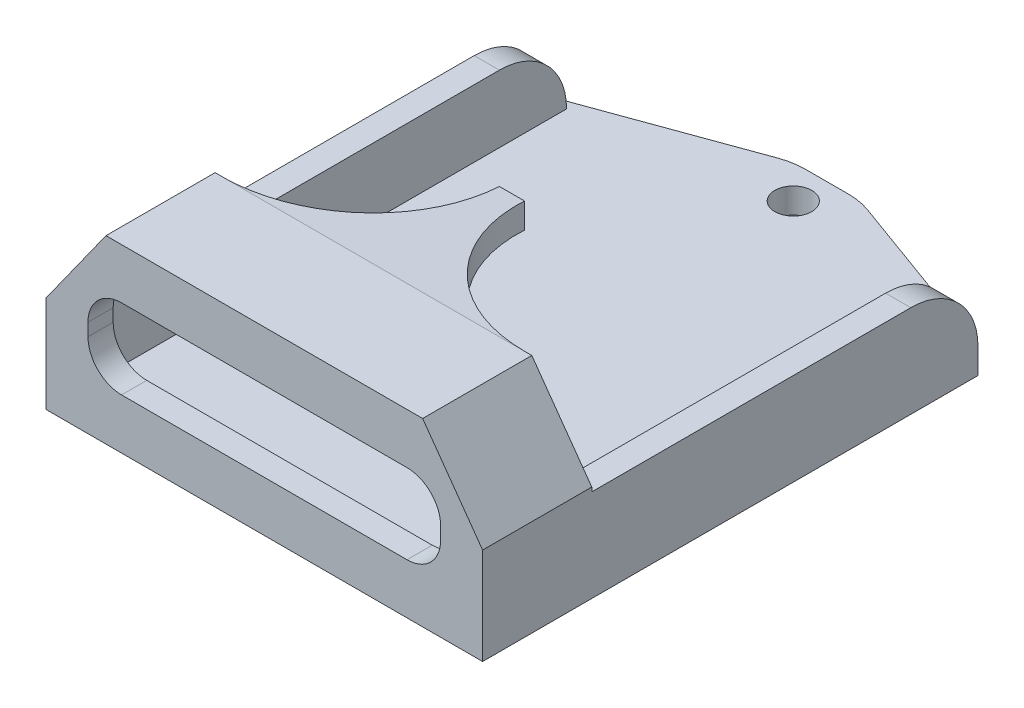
ISO-10303-21;
HEADER;
FILE_DESCRIPTION(('STEP AP214'),'2;1');
FILE_NAME('part.step','',(''),(''),'','','');
FILE_SCHEMA(('AUTOMOTIVE_DESIGN { 1 0 10303 214 1 1 1 1 }'));
ENDSEC;
DATA;
#1=APPLICATION_CONTEXT('core data for automotive mechanical design processes');
#2=APPLICATION_PROTOCOL_DEFINITION('international standard','automotive_design',2000,#1);
#3=PRODUCT_CONTEXT('',#1,'mechanical');
#4=PRODUCT('Part','Part','',(#3));
#5=PRODUCT_RELATED_PRODUCT_CATEGORY('part','',(#4));
#6=PRODUCT_DEFINITION_FORMATION('','',#4);
#7=PRODUCT_DEFINITION_CONTEXT('part definition',#1,'design');
#8=PRODUCT_DEFINITION('design','',#6,#7);
#9=PRODUCT_DEFINITION_SHAPE('','',#8);
#10=(LENGTH_UNIT() NAMED_UNIT(*) SI_UNIT(.MILLI.,.METRE.));
#11=(NAMED_UNIT(*) PLANE_ANGLE_UNIT() SI_UNIT($,.RADIAN.));
#12=(NAMED_UNIT(*) SI_UNIT($,.STERADIAN.) SOLID_ANGLE_UNIT());
#13=UNCERTAINTY_MEASURE_WITH_UNIT(LENGTH_MEASURE(1.E-05),#10,'distance_accuracy_value','');
#14=(GEOMETRIC_REPRESENTATION_CONTEXT(3) GLOBAL_UNCERTAINTY_ASSIGNED_CONTEXT((#13)) GLOBAL_UNIT_ASSIGNED_CONTEXT((#10,
#11,#12)) REPRESENTATION_CONTEXT('',''));
#15=CARTESIAN_POINT('',(0.,0.,0.));
#16=DIRECTION('',(0.,0.,1.));
#17=DIRECTION('',(1.,0.,0.));
#18=AXIS2_PLACEMENT_3D('',#15,#16,#17);
#19=CARTESIAN_POINT('',(0.,0.,16.5));
#20=DIRECTION('',(0.,0.,1.));
#21=DIRECTION('',(1.,0.,0.));
#22=AXIS2_PLACEMENT_3D('',#19,#20,#21);
#23=PLANE('',#22);
#24=DIRECTION('',(1.,0.,0.));
#25=VECTOR('',#24,1.);
#26=CARTESIAN_POINT('',(0.,21.5,16.5));
#27=LINE('',#26,#25);
#28=CARTESIAN_POINT('',(18.,21.5,16.5));
#29=VERTEX_POINT('',#28);
#30=CARTESIAN_POINT('',(18.8571428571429,21.5,16.5));
#31=VERTEX_POINT('',#30);
#32=EDGE_CURVE('E409',#29,#31,#27,.T.);
#33=ORIENTED_EDGE('',*,*,#32,.T.);
#34=DIRECTION('',(-0.581238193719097,0.813733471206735,0.));
#35=VECTOR('',#34,1.);
#36=CARTESIAN_POINT('',(22.6554054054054,16.1824324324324,16.5));
#37=LINE('',#36,#35);
#38=CARTESIAN_POINT('',(26.,11.5,16.5));
#39=VERTEX_POINT('',#38);
#40=EDGE_CURVE('E407',#39,#31,#37,.T.);
#41=ORIENTED_EDGE('',*,*,#40,.F.);
#42=DIRECTION('',(0.,1.,0.));
#43=VECTOR('',#42,1.);
#44=CARTESIAN_POINT('',(26.,0.,16.5));
#45=LINE('',#44,#43);
#46=CARTESIAN_POINT('',(26.,11.,16.5));
#47=VERTEX_POINT('',#46);
#48=EDGE_CURVE('E405',#47,#39,#45,.T.);
#49=ORIENTED_EDGE('',*,*,#48,.F.);
#50=DIRECTION('',(1.,0.,0.));
#51=VECTOR('',#50,1.);
#52=CARTESIAN_POINT('',(26.,11.,16.5));
#53=LINE('',#52,#51);
#54=CARTESIAN_POINT('',(23.,11.,16.5));
#55=VERTEX_POINT('',#54);
#56=EDGE_CURVE('E319',#55,#47,#53,.T.);
#57=ORIENTED_EDGE('',*,*,#56,.F.);
#58=DIRECTION('',(0.,-1.,0.));
#59=VECTOR('',#58,1.);
#60=CARTESIAN_POINT('',(23.,0.,16.5));
#61=LINE('',#60,#59);
#62=CARTESIAN_POINT('',(23.,11.5,16.5));
#63=VERTEX_POINT('',#62);
#64=EDGE_CURVE('E258',#63,#55,#61,.T.);
#65=ORIENTED_EDGE('',*,*,#64,.F.);
#66=DIRECTION('',(-0.581238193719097,0.813733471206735,0.));
#67=VECTOR('',#66,1.);
#68=CARTESIAN_POINT('',(20.6689189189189,14.7635135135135,16.5));
#69=LINE('',#68,#67);
#70=CARTESIAN_POINT('',(18.,18.5,16.5));
#71=VERTEX_POINT('',#70);
#72=EDGE_CURVE('E251',#63,#71,#69,.T.);
#73=ORIENTED_EDGE('',*,*,#72,.T.);
#74=DIRECTION('',(0.,1.,0.));
#75=VECTOR('',#74,1.);
#76=CARTESIAN_POINT('',(18.,17.5,16.5));
#77=LINE('',#76,#75);
#78=EDGE_CURVE('E255',#71,#29,#77,.T.);
#79=ORIENTED_EDGE('',*,*,#78,.T.);
#80=EDGE_LOOP('',(#33,#41,#49,#57,#65,#73,#79));
#81=FACE_BOUND('',#80,.T.);
#82=ADVANCED_FACE('F41',(#81),#23,.F.);
#83=CARTESIAN_POINT('',(0.,3.,0.));
#84=DIRECTION('',(0.,1.,0.));
#85=DIRECTION('',(0.,0.,1.));
#86=AXIS2_PLACEMENT_3D('',#83,#84,#85);
#87=PLANE('',#86);
#88=CARTESIAN_POINT('',(0.,3.,-33.5));
#89=DIRECTION('',(0.,1.,0.));
#90=DIRECTION('',(0.,0.,1.));
#91=AXIS2_PLACEMENT_3D('',#88,#89,#90);
#92=CIRCLE('',#91,2.2);
#93=CARTESIAN_POINT('',(0.,3.,-31.3));
#94=VERTEX_POINT('',#93);
#95=EDGE_CURVE('E450',#94,#94,#92,.T.);
#96=ORIENTED_EDGE('',*,*,#95,.F.);
#97=EDGE_LOOP('',(#96));
#98=FACE_BOUND('',#97,.T.);
#99=DIRECTION('',(-1.,0.,0.));
#100=VECTOR('',#99,1.);
#101=CARTESIAN_POINT('',(-4.,3.,-37.5));
#102=LINE('',#101,#100);
#103=CARTESIAN_POINT('',(2.59060017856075,3.,-37.5));
#104=VERTEX_POINT('',#103);
#105=CARTESIAN_POINT('',(-2.59060017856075,3.,-37.5));
#106=VERTEX_POINT('',#105);
#107=EDGE_CURVE('E459',#104,#106,#102,.T.);
#108=ORIENTED_EDGE('',*,*,#107,.T.);
#109=CARTESIAN_POINT('',(-2.59060017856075,3.,-29.5));
#110=DIRECTION('',(0.,1.,0.));
#111=DIRECTION('',(0.,0.,1.));
#112=AXIS2_PLACEMENT_3D('',#109,#110,#111);
#113=CIRCLE('',#112,8.);
#114=CARTESIAN_POINT('',(-5.32454468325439,3.,-37.0183473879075));
#115=VERTEX_POINT('',#114);
#116=EDGE_CURVE('E504',#106,#115,#113,.T.);
#117=ORIENTED_EDGE('',*,*,#116,.T.);
#118=DIRECTION('',(-0.939793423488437,0.,0.341743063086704));
#119=VECTOR('',#118,1.);
#120=CARTESIAN_POINT('',(-26.,3.,-29.5));
#121=LINE('',#120,#119);
#122=CARTESIAN_POINT('',(-26.,3.,-29.5));
#123=VERTEX_POINT('',#122);
#124=EDGE_CURVE('E463',#115,#123,#121,.T.);
#125=ORIENTED_EDGE('',*,*,#124,.T.);
#126=DIRECTION('',(-1.,0.,0.));
#127=VECTOR('',#126,1.);
#128=CARTESIAN_POINT('',(-26.,3.,-29.5));
#129=LINE('',#128,#127);
#130=CARTESIAN_POINT('',(-23.,3.,-29.5));
#131=VERTEX_POINT('',#130);
#132=EDGE_CURVE('E309',#131,#123,#129,.T.);
#133=ORIENTED_EDGE('',*,*,#132,.F.);
#134=DIRECTION('',(0.,0.,1.));
#135=VECTOR('',#134,1.);
#136=CARTESIAN_POINT('',(-23.,3.,16.5));
#137=LINE('',#136,#135);
#138=CARTESIAN_POINT('',(-23.,3.,26.5));
#139=VERTEX_POINT('',#138);
#140=EDGE_CURVE('E432',#131,#139,#137,.T.);
#141=ORIENTED_EDGE('',*,*,#140,.T.);
#142=DIRECTION('',(-1.,0.,0.));
#143=VECTOR('',#142,1.);
#144=CARTESIAN_POINT('',(0.,3.,26.5));
#145=LINE('',#144,#143);
#146=CARTESIAN_POINT('',(23.,3.,26.5));
#147=VERTEX_POINT('',#146);
#148=EDGE_CURVE('E375',#147,#139,#145,.T.);
#149=ORIENTED_EDGE('',*,*,#148,.F.);
#150=DIRECTION('',(0.,0.,1.));
#151=VECTOR('',#150,1.);
#152=CARTESIAN_POINT('',(23.,3.,16.5));
#153=LINE('',#152,#151);
#154=CARTESIAN_POINT('',(23.,3.,-29.5));
#155=VERTEX_POINT('',#154);
#156=EDGE_CURVE('E446',#155,#147,#153,.T.);
#157=ORIENTED_EDGE('',*,*,#156,.F.);
#158=DIRECTION('',(-1.,0.,0.));
#159=VECTOR('',#158,1.);
#160=CARTESIAN_POINT('',(26.,3.,-29.5));
#161=LINE('',#160,#159);
#162=CARTESIAN_POINT('',(26.,3.,-29.5));
#163=VERTEX_POINT('',#162);
#164=EDGE_CURVE('E315',#163,#155,#161,.T.);
#165=ORIENTED_EDGE('',*,*,#164,.F.);
#166=DIRECTION('',(-0.939793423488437,0.,-0.341743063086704));
#167=VECTOR('',#166,1.);
#168=CARTESIAN_POINT('',(4.,3.,-37.5));
#169=LINE('',#168,#167);
#170=CARTESIAN_POINT('',(5.32454468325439,3.,-37.0183473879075));
#171=VERTEX_POINT('',#170);
#172=EDGE_CURVE('E456',#163,#171,#169,.T.);
#173=ORIENTED_EDGE('',*,*,#172,.T.);
#174=CARTESIAN_POINT('',(2.59060017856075,3.,-29.5));
#175=DIRECTION('',(0.,1.,0.));
#176=DIRECTION('',(0.,0.,1.));
#177=AXIS2_PLACEMENT_3D('',#174,#175,#176);
#178=CIRCLE('',#177,8.);
#179=EDGE_CURVE('E502',#171,#104,#178,.T.);
#180=ORIENTED_EDGE('',*,*,#179,.T.);
#181=EDGE_LOOP('',(#108,#117,#125,#133,#141,#149,#157,#165,#173,#180));
#182=FACE_BOUND('',#181,.T.);
#183=ADVANCED_FACE('F526',(#98,#182),#87,.T.);
#184=DIRECTION('',(0.,1.,0.));
#185=VECTOR('',#184,1.);
#186=CARTESIAN_POINT('',(-18.,17.5,16.5));
#187=LINE('',#186,#185);
#188=CARTESIAN_POINT('',(-18.,18.5,16.5));
#189=VERTEX_POINT('',#188);
#190=CARTESIAN_POINT('',(-18.,21.5,16.5));
#191=VERTEX_POINT('',#190);
#192=EDGE_CURVE('E298',#189,#191,#187,.T.);
#193=ORIENTED_EDGE('',*,*,#192,.F.);
#194=DIRECTION('',(0.581238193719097,0.813733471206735,0.));
#195=VECTOR('',#194,1.);
#196=CARTESIAN_POINT('',(-20.6689189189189,14.7635135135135,16.5));
#197=LINE('',#196,#195);
#198=CARTESIAN_POINT('',(-23.,11.5,16.5));
#199=VERTEX_POINT('',#198);
#200=EDGE_CURVE('E286',#199,#189,#197,.T.);
#201=ORIENTED_EDGE('',*,*,#200,.F.);
#202=DIRECTION('',(0.,-1.,0.));
#203=VECTOR('',#202,1.);
#204=CARTESIAN_POINT('',(-23.,0.,16.5));
#205=LINE('',#204,#203);
#206=CARTESIAN_POINT('',(-23.,11.,16.5));
#207=VERTEX_POINT('',#206);
#208=EDGE_CURVE('E417',#199,#207,#205,.T.);
#209=ORIENTED_EDGE('',*,*,#208,.T.);
#210=DIRECTION('',(1.,0.,0.));
#211=VECTOR('',#210,1.);
#212=CARTESIAN_POINT('',(-26.,11.,16.5));
#213=LINE('',#212,#211);
#214=CARTESIAN_POINT('',(-26.,11.,16.5));
#215=VERTEX_POINT('',#214);
#216=EDGE_CURVE('E308',#215,#207,#213,.T.);
#217=ORIENTED_EDGE('',*,*,#216,.F.);
#218=DIRECTION('',(0.,1.,0.));
#219=VECTOR('',#218,1.);
#220=CARTESIAN_POINT('',(-26.,0.,16.5));
#221=LINE('',#220,#219);
#222=CARTESIAN_POINT('',(-26.,11.5,16.5));
#223=VERTEX_POINT('',#222);
#224=EDGE_CURVE('E415',#215,#223,#221,.T.);
#225=ORIENTED_EDGE('',*,*,#224,.T.);
#226=DIRECTION('',(0.581238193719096,0.813733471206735,0.));
#227=VECTOR('',#226,1.);
#228=CARTESIAN_POINT('',(-22.6554054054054,16.1824324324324,16.5));
#229=LINE('',#228,#227);
#230=CARTESIAN_POINT('',(-18.8571428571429,21.5,16.5));
#231=VERTEX_POINT('',#230);
#232=EDGE_CURVE('E413',#223,#231,#229,.T.);
#233=ORIENTED_EDGE('',*,*,#232,.T.);
#234=EDGE_CURVE('E410',#231,#191,#27,.T.);
#235=ORIENTED_EDGE('',*,*,#234,.T.);
#236=EDGE_LOOP('',(#193,#201,#209,#217,#225,#233,#235));
#237=FACE_BOUND('',#236,.T.);
#238=ADVANCED_FACE('F540',(#237),#23,.F.);
#239=CARTESIAN_POINT('',(0.,18.5,16.5));
#240=DIRECTION('',(0.,-1.,0.));
#241=DIRECTION('',(0.,0.,-1.));
#242=AXIS2_PLACEMENT_3D('',#239,#240,#241);
#243=PLANE('',#242);
#244=DIRECTION('',(0.,0.,1.));
#245=VECTOR('',#244,1.);
#246=CARTESIAN_POINT('',(18.,18.5,16.5));
#247=LINE('',#246,#245);
#248=CARTESIAN_POINT('',(18.,18.5,26.5));
#249=VERTEX_POINT('',#248);
#250=EDGE_CURVE('E279',#71,#249,#247,.T.);
#251=ORIENTED_EDGE('',*,*,#250,.T.);
#252=DIRECTION('',(1.,0.,0.));
#253=VECTOR('',#252,1.);
#254=CARTESIAN_POINT('',(0.,18.5,26.5));
#255=LINE('',#254,#253);
#256=CARTESIAN_POINT('',(-18.,18.5,26.5));
#257=VERTEX_POINT('',#256);
#258=EDGE_CURVE('E396',#257,#249,#255,.T.);
#259=ORIENTED_EDGE('',*,*,#258,.F.);
#260=DIRECTION('',(0.,0.,1.));
#261=VECTOR('',#260,1.);
#262=CARTESIAN_POINT('',(-18.,18.5,16.5));
#263=LINE('',#262,#261);
#264=EDGE_CURVE('E291',#189,#257,#263,.T.);
#265=ORIENTED_EDGE('',*,*,#264,.F.);
#266=DIRECTION('',(1.,0.,0.));
#267=VECTOR('',#266,1.);
#268=CARTESIAN_POINT('',(0.,18.5,16.5));
#269=LINE('',#268,#267);
#270=EDGE_CURVE('E261',#189,#71,#269,.T.);
#271=ORIENTED_EDGE('',*,*,#270,.T.);
#272=EDGE_LOOP('',(#251,#259,#265,#271));
#273=FACE_BOUND('',#272,.T.);
#274=ADVANCED_FACE('F289',(#273),#243,.T.);
#275=CARTESIAN_POINT('',(-20.6689189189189,14.7635135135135,16.5));
#276=DIRECTION('',(0.813733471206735,-0.581238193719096,0.));
#277=DIRECTION('',(0.581238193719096,0.813733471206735,0.));
#278=AXIS2_PLACEMENT_3D('',#275,#276,#277);
#279=PLANE('',#278);
#280=ORIENTED_EDGE('',*,*,#264,.T.);
#281=DIRECTION('',(0.581238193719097,0.813733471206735,0.));
#282=VECTOR('',#281,1.);
#283=CARTESIAN_POINT('',(-20.6689189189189,14.7635135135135,26.5));
#284=LINE('',#283,#282);
#285=CARTESIAN_POINT('',(-23.,11.5,26.5));
#286=VERTEX_POINT('',#285);
#287=EDGE_CURVE('E398',#286,#257,#284,.T.);
#288=ORIENTED_EDGE('',*,*,#287,.F.);
#289=DIRECTION('',(0.,0.,1.));
#290=VECTOR('',#289,1.);
#291=CARTESIAN_POINT('',(-23.,11.5,16.5));
#292=LINE('',#291,#290);
#293=EDGE_CURVE('E429',#199,#286,#292,.T.);
#294=ORIENTED_EDGE('',*,*,#293,.F.);
#295=ORIENTED_EDGE('',*,*,#200,.T.);
#296=EDGE_LOOP('',(#280,#288,#294,#295));
#297=FACE_BOUND('',#296,.T.);
#298=ADVANCED_FACE('F542',(#297),#279,.T.);
#299=CARTESIAN_POINT('',(-23.,0.,16.5));
#300=DIRECTION('',(-1.,0.,0.));
#301=DIRECTION('',(0.,0.,1.));
#302=AXIS2_PLACEMENT_3D('',#299,#300,#301);
#303=PLANE('',#302);
#304=ORIENTED_EDGE('',*,*,#140,.F.);
#305=CARTESIAN_POINT('',(-23.,3.,-21.5));
#306=DIRECTION('',(-1.,0.,0.));
#307=DIRECTION('',(0.,0.,1.));
#308=AXIS2_PLACEMENT_3D('',#305,#306,#307);
#309=CIRCLE('',#308,8.);
#310=CARTESIAN_POINT('',(-23.,11.,-21.5));
#311=VERTEX_POINT('',#310);
#312=EDGE_CURVE('E49',#131,#311,#309,.F.);
#313=ORIENTED_EDGE('',*,*,#312,.T.);
#314=DIRECTION('',(0.,0.,-1.));
#315=VECTOR('',#314,1.);
#316=CARTESIAN_POINT('',(-23.,11.,-29.5));
#317=LINE('',#316,#315);
#318=EDGE_CURVE('E311',#207,#311,#317,.T.);
#319=ORIENTED_EDGE('',*,*,#318,.F.);
#320=ORIENTED_EDGE('',*,*,#208,.F.);
#321=ORIENTED_EDGE('',*,*,#293,.T.);
#322=DIRECTION('',(0.,-1.,0.));
#323=VECTOR('',#322,1.);
#324=CARTESIAN_POINT('',(-23.,0.,26.5));
#325=LINE('',#324,#323);
#326=EDGE_CURVE('E401',#286,#139,#325,.T.);
#327=ORIENTED_EDGE('',*,*,#326,.T.);
#328=EDGE_LOOP('',(#304,#313,#319,#320,#321,#327));
#329=FACE_BOUND('',#328,.T.);
#330=ADVANCED_FACE('F536',(#329),#303,.F.);
#331=CARTESIAN_POINT('',(23.,0.,16.5));
#332=DIRECTION('',(-1.,0.,0.));
#333=DIRECTION('',(0.,0.,1.));
#334=AXIS2_PLACEMENT_3D('',#331,#332,#333);
#335=PLANE('',#334);
#336=DIRECTION('',(0.,0.,1.));
#337=VECTOR('',#336,1.);
#338=CARTESIAN_POINT('',(23.,11.,-29.5));
#339=LINE('',#338,#337);
#340=CARTESIAN_POINT('',(23.,11.,-21.5));
#341=VERTEX_POINT('',#340);
#342=EDGE_CURVE('E322',#341,#55,#339,.T.);
#343=ORIENTED_EDGE('',*,*,#342,.F.);
#344=CARTESIAN_POINT('',(23.,3.,-21.5));
#345=DIRECTION('',(-1.,0.,0.));
#346=DIRECTION('',(0.,0.,1.));
#347=AXIS2_PLACEMENT_3D('',#344,#345,#346);
#348=CIRCLE('',#347,8.);
#349=EDGE_CURVE('E511',#341,#155,#348,.T.);
#350=ORIENTED_EDGE('',*,*,#349,.T.);
#351=ORIENTED_EDGE('',*,*,#156,.T.);
#352=DIRECTION('',(0.,-1.,0.));
#353=VECTOR('',#352,1.);
#354=CARTESIAN_POINT('',(23.,0.,26.5));
#355=LINE('',#354,#353);
#356=CARTESIAN_POINT('',(23.,11.5,26.5));
#357=VERTEX_POINT('',#356);
#358=EDGE_CURVE('E392',#357,#147,#355,.T.);
#359=ORIENTED_EDGE('',*,*,#358,.F.);
#360=DIRECTION('',(0.,0.,1.));
#361=VECTOR('',#360,1.);
#362=CARTESIAN_POINT('',(23.,11.5,16.5));
#363=LINE('',#362,#361);
#364=EDGE_CURVE('E285',#63,#357,#363,.T.);
#365=ORIENTED_EDGE('',*,*,#364,.F.);
#366=ORIENTED_EDGE('',*,*,#64,.T.);
#367=EDGE_LOOP('',(#343,#350,#351,#359,#365,#366));
#368=FACE_BOUND('',#367,.T.);
#369=ADVANCED_FACE('F550',(#368),#335,.T.);
#370=CARTESIAN_POINT('',(20.6689189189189,14.7635135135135,16.5));
#371=DIRECTION('',(0.813733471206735,0.581238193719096,0.));
#372=DIRECTION('',(-0.581238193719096,0.813733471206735,0.));
#373=AXIS2_PLACEMENT_3D('',#370,#371,#372);
#374=PLANE('',#373);
#375=DIRECTION('',(-0.581238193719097,0.813733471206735,0.));
#376=VECTOR('',#375,1.);
#377=CARTESIAN_POINT('',(20.6689189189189,14.7635135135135,26.5));
#378=LINE('',#377,#376);
#379=EDGE_CURVE('E282',#357,#249,#378,.T.);
#380=ORIENTED_EDGE('',*,*,#379,.T.);
#381=ORIENTED_EDGE('',*,*,#250,.F.);
#382=ORIENTED_EDGE('',*,*,#72,.F.);
#383=ORIENTED_EDGE('',*,*,#364,.T.);
#384=EDGE_LOOP('',(#380,#381,#382,#383));
#385=FACE_BOUND('',#384,.T.);
#386=ADVANCED_FACE('F280',(#385),#374,.F.);
#387=CARTESIAN_POINT('',(0.,0.,0.));
#388=DIRECTION('',(0.,1.,0.));
#389=DIRECTION('',(0.,0.,1.));
#390=AXIS2_PLACEMENT_3D('',#387,#388,#389);
#391=PLANE('',#390);
#392=DIRECTION('',(-0.939793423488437,0.,0.341743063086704));
#393=VECTOR('',#392,1.);
#394=CARTESIAN_POINT('',(-26.,0.,-29.5));
#395=LINE('',#394,#393);
#396=CARTESIAN_POINT('',(-5.32454468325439,0.,-37.0183473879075));
#397=VERTEX_POINT('',#396);
#398=CARTESIAN_POINT('',(-26.,0.,-29.5));
#399=VERTEX_POINT('',#398);
#400=EDGE_CURVE('E472',#397,#399,#395,.T.);
#401=ORIENTED_EDGE('',*,*,#400,.F.);
#402=CARTESIAN_POINT('',(-2.59060017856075,0.,-29.5));
#403=DIRECTION('',(0.,1.,0.));
#404=DIRECTION('',(0.,0.,1.));
#405=AXIS2_PLACEMENT_3D('',#402,#403,#404);
#406=CIRCLE('',#405,8.);
#407=CARTESIAN_POINT('',(-2.59060017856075,0.,-37.5));
#408=VERTEX_POINT('',#407);
#409=EDGE_CURVE('E495',#397,#408,#406,.F.);
#410=ORIENTED_EDGE('',*,*,#409,.T.);
#411=DIRECTION('',(-1.,0.,0.));
#412=VECTOR('',#411,1.);
#413=CARTESIAN_POINT('',(-4.,0.,-37.5));
#414=LINE('',#413,#412);
#415=CARTESIAN_POINT('',(2.59060017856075,0.,-37.5));
#416=VERTEX_POINT('',#415);
#417=EDGE_CURVE('E469',#416,#408,#414,.T.);
#418=ORIENTED_EDGE('',*,*,#417,.F.);
#419=CARTESIAN_POINT('',(2.59060017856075,0.,-29.5));
#420=DIRECTION('',(0.,1.,0.));
#421=DIRECTION('',(0.,0.,1.));
#422=AXIS2_PLACEMENT_3D('',#419,#420,#421);
#423=CIRCLE('',#422,8.);
#424=CARTESIAN_POINT('',(5.32454468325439,0.,-37.0183473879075));
#425=VERTEX_POINT('',#424);
#426=EDGE_CURVE('E493',#416,#425,#423,.F.);
#427=ORIENTED_EDGE('',*,*,#426,.T.);
#428=DIRECTION('',(-0.939793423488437,0.,-0.341743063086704));
#429=VECTOR('',#428,1.);
#430=CARTESIAN_POINT('',(4.,0.,-37.5));
#431=LINE('',#430,#429);
#432=CARTESIAN_POINT('',(26.,0.,-29.5));
#433=VERTEX_POINT('',#432);
#434=EDGE_CURVE('E453',#433,#425,#431,.T.);
#435=ORIENTED_EDGE('',*,*,#434,.F.);
#436=DIRECTION('',(0.,0.,-1.));
#437=VECTOR('',#436,1.);
#438=CARTESIAN_POINT('',(26.,0.,29.5));
#439=LINE('',#438,#437);
#440=CARTESIAN_POINT('',(26.,0.,29.5));
#441=VERTEX_POINT('',#440);
#442=EDGE_CURVE('E460',#441,#433,#439,.T.);
#443=ORIENTED_EDGE('',*,*,#442,.F.);
#444=DIRECTION('',(1.,0.,0.));
#445=VECTOR('',#444,1.);
#446=CARTESIAN_POINT('',(-26.,0.,29.5));
#447=LINE('',#446,#445);
#448=CARTESIAN_POINT('',(-26.,0.,29.5));
#449=VERTEX_POINT('',#448);
#450=EDGE_CURVE('E476',#449,#441,#447,.T.);
#451=ORIENTED_EDGE('',*,*,#450,.F.);
#452=DIRECTION('',(0.,0.,1.));
#453=VECTOR('',#452,1.);
#454=CARTESIAN_POINT('',(-26.,0.,29.5));
#455=LINE('',#454,#453);
#456=EDGE_CURVE('E474',#399,#449,#455,.T.);
#457=ORIENTED_EDGE('',*,*,#456,.F.);
#458=EDGE_LOOP('',(#401,#410,#418,#427,#435,#443,#451,#457));
#459=FACE_BOUND('',#458,.T.);
#460=CARTESIAN_POINT('',(0.,0.,-33.5));
#461=DIRECTION('',(0.,1.,0.));
#462=DIRECTION('',(0.,0.,1.));
#463=AXIS2_PLACEMENT_3D('',#460,#461,#462);
#464=CIRCLE('',#463,2.2);
#465=CARTESIAN_POINT('',(0.,0.,-31.3));
#466=VERTEX_POINT('',#465);
#467=EDGE_CURVE('E428',#466,#466,#464,.T.);
#468=ORIENTED_EDGE('',*,*,#467,.T.);
#469=EDGE_LOOP('',(#468));
#470=FACE_BOUND('',#469,.T.);
#471=ADVANCED_FACE('F578',(#459,#470),#391,.F.);
#472=CARTESIAN_POINT('',(4.,3.,-37.5));
#473=DIRECTION('',(-0.341743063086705,0.,0.939793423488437));
#474=DIRECTION('',(0.939793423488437,0.,0.341743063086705));
#475=AXIS2_PLACEMENT_3D('',#472,#473,#474);
#476=PLANE('',#475);
#477=ORIENTED_EDGE('',*,*,#434,.T.);
#478=DIRECTION('',(0.,-1.,0.));
#479=VECTOR('',#478,1.);
#480=CARTESIAN_POINT('',(5.32454468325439,3.,-37.0183473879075));
#481=LINE('',#480,#479);
#482=EDGE_CURVE('E506',#425,#171,#481,.F.);
#483=ORIENTED_EDGE('',*,*,#482,.T.);
#484=ORIENTED_EDGE('',*,*,#172,.F.);
#485=DIRECTION('',(0.,-1.,0.));
#486=VECTOR('',#485,1.);
#487=CARTESIAN_POINT('',(26.,3.,-29.5));
#488=LINE('',#487,#486);
#489=EDGE_CURVE('E466',#163,#433,#488,.T.);
#490=ORIENTED_EDGE('',*,*,#489,.T.);
#491=EDGE_LOOP('',(#477,#483,#484,#490));
#492=FACE_BOUND('',#491,.T.);
#493=ADVANCED_FACE('F566',(#492),#476,.F.);
#494=CARTESIAN_POINT('',(-4.,3.,-37.5));
#495=DIRECTION('',(0.,0.,1.));
#496=DIRECTION('',(1.,0.,0.));
#497=AXIS2_PLACEMENT_3D('',#494,#495,#496);
#498=PLANE('',#497);
#499=ORIENTED_EDGE('',*,*,#417,.T.);
#500=DIRECTION('',(0.,-1.,0.));
#501=VECTOR('',#500,1.);
#502=CARTESIAN_POINT('',(-2.59060017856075,3.,-37.5));
#503=LINE('',#502,#501);
#504=EDGE_CURVE('E500',#408,#106,#503,.F.);
#505=ORIENTED_EDGE('',*,*,#504,.T.);
#506=ORIENTED_EDGE('',*,*,#107,.F.);
#507=DIRECTION('',(0.,-1.,0.));
#508=VECTOR('',#507,1.);
#509=CARTESIAN_POINT('',(2.59060017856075,3.,-37.5));
#510=LINE('',#509,#508);
#511=EDGE_CURVE('E497',#104,#416,#510,.T.);
#512=ORIENTED_EDGE('',*,*,#511,.T.);
#513=EDGE_LOOP('',(#499,#505,#506,#512));
#514=FACE_BOUND('',#513,.T.);
#515=ADVANCED_FACE('F575',(#514),#498,.F.);
#516=CARTESIAN_POINT('',(-26.,3.,-29.5));
#517=DIRECTION('',(0.341743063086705,0.,0.939793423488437));
#518=DIRECTION('',(0.939793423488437,0.,-0.341743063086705));
#519=AXIS2_PLACEMENT_3D('',#516,#517,#518);
#520=PLANE('',#519);
#521=ORIENTED_EDGE('',*,*,#124,.F.);
#522=DIRECTION('',(0.,-1.,0.));
#523=VECTOR('',#522,1.);
#524=CARTESIAN_POINT('',(-5.32454468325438,3.,-37.0183473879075));
#525=LINE('',#524,#523);
#526=EDGE_CURVE('E490',#115,#397,#525,.T.);
#527=ORIENTED_EDGE('',*,*,#526,.T.);
#528=ORIENTED_EDGE('',*,*,#400,.T.);
#529=DIRECTION('',(0.,-1.,0.));
#530=VECTOR('',#529,1.);
#531=CARTESIAN_POINT('',(-26.,3.,-29.5));
#532=LINE('',#531,#530);
#533=EDGE_CURVE('E487',#123,#399,#532,.T.);
#534=ORIENTED_EDGE('',*,*,#533,.F.);
#535=EDGE_LOOP('',(#521,#527,#528,#534));
#536=FACE_BOUND('',#535,.T.);
#537=ADVANCED_FACE('F530',(#536),#520,.F.);
#538=CARTESIAN_POINT('',(-26.,3.,29.5));
#539=DIRECTION('',(1.,0.,0.));
#540=DIRECTION('',(0.,0.,-1.));
#541=AXIS2_PLACEMENT_3D('',#538,#539,#540);
#542=PLANE('',#541);
#543=DIRECTION('',(0.,0.,1.));
#544=VECTOR('',#543,1.);
#545=CARTESIAN_POINT('',(-26.,11.,-29.5));
#546=LINE('',#545,#544);
#547=CARTESIAN_POINT('',(-26.,11.,-21.5));
#548=VERTEX_POINT('',#547);
#549=EDGE_CURVE('E306',#548,#215,#546,.T.);
#550=ORIENTED_EDGE('',*,*,#549,.F.);
#551=CARTESIAN_POINT('',(-26.,3.,-21.5));
#552=DIRECTION('',(1.,0.,0.));
#553=DIRECTION('',(0.,0.,-1.));
#554=AXIS2_PLACEMENT_3D('',#551,#552,#553);
#555=CIRCLE('',#554,8.);
#556=EDGE_CURVE('E63',#548,#123,#555,.F.);
#557=ORIENTED_EDGE('',*,*,#556,.T.);
#558=ORIENTED_EDGE('',*,*,#533,.T.);
#559=ORIENTED_EDGE('',*,*,#456,.T.);
#560=DIRECTION('',(0.,-1.,0.));
#561=VECTOR('',#560,1.);
#562=CARTESIAN_POINT('',(-26.,3.,29.5));
#563=LINE('',#562,#561);
#564=CARTESIAN_POINT('',(-26.,11.5,29.5));
#565=VERTEX_POINT('',#564);
#566=EDGE_CURVE('E484',#565,#449,#563,.T.);
#567=ORIENTED_EDGE('',*,*,#566,.F.);
#568=DIRECTION('',(0.,0.,1.));
#569=VECTOR('',#568,1.);
#570=CARTESIAN_POINT('',(-26.,11.5,16.5));
#571=LINE('',#570,#569);
#572=EDGE_CURVE('E435',#223,#565,#571,.T.);
#573=ORIENTED_EDGE('',*,*,#572,.F.);
#574=ORIENTED_EDGE('',*,*,#224,.F.);
#575=EDGE_LOOP('',(#550,#557,#558,#559,#567,#573,#574));
#576=FACE_BOUND('',#575,.T.);
#577=ADVANCED_FACE('F519',(#576),#542,.F.);
#578=CARTESIAN_POINT('',(-26.,3.,29.5));
#579=DIRECTION('',(0.,0.,-1.));
#580=DIRECTION('',(-1.,0.,0.));
#581=AXIS2_PLACEMENT_3D('',#578,#579,#580);
#582=PLANE('',#581);
#583=DIRECTION('',(-1.,0.,0.));
#584=VECTOR('',#583,1.);
#585=CARTESIAN_POINT('',(-17.,15.5,29.5));
#586=LINE('',#585,#584);
#587=CARTESIAN_POINT('',(17.,15.5,29.5));
#588=VERTEX_POINT('',#587);
#589=CARTESIAN_POINT('',(-17.,15.5,29.5));
#590=VERTEX_POINT('',#589);
#591=EDGE_CURVE('E353',#588,#590,#586,.T.);
#592=ORIENTED_EDGE('',*,*,#591,.F.);
#593=CARTESIAN_POINT('',(17.,11.5,29.5));
#594=DIRECTION('',(0.,0.,1.));
#595=DIRECTION('',(-1.,0.,0.));
#596=AXIS2_PLACEMENT_3D('',#593,#594,#595);
#597=CIRCLE('',#596,4.);
#598=CARTESIAN_POINT('',(21.,11.5,29.5));
#599=VERTEX_POINT('',#598);
#600=EDGE_CURVE('E313',#599,#588,#597,.T.);
#601=ORIENTED_EDGE('',*,*,#600,.F.);
#602=DIRECTION('',(0.,1.,0.));
#603=VECTOR('',#602,1.);
#604=CARTESIAN_POINT('',(21.,11.5,29.5));
#605=LINE('',#604,#603);
#606=CARTESIAN_POINT('',(21.,10.,29.5));
#607=VERTEX_POINT('',#606);
#608=EDGE_CURVE('E330',#607,#599,#605,.T.);
#609=ORIENTED_EDGE('',*,*,#608,.F.);
#610=CARTESIAN_POINT('',(17.,10.,29.5));
#611=DIRECTION('',(0.,0.,1.));
#612=DIRECTION('',(1.,0.,0.));
#613=AXIS2_PLACEMENT_3D('',#610,#611,#612);
#614=CIRCLE('',#613,4.);
#615=CARTESIAN_POINT('',(17.,6.,29.5));
#616=VERTEX_POINT('',#615);
#617=EDGE_CURVE('E368',#616,#607,#614,.T.);
#618=ORIENTED_EDGE('',*,*,#617,.F.);
#619=DIRECTION('',(1.,0.,0.));
#620=VECTOR('',#619,1.);
#621=CARTESIAN_POINT('',(-17.,6.,29.5));
#622=LINE('',#621,#620);
#623=CARTESIAN_POINT('',(-17.,6.,29.5));
#624=VERTEX_POINT('',#623);
#625=EDGE_CURVE('E365',#624,#616,#622,.T.);
#626=ORIENTED_EDGE('',*,*,#625,.F.);
#627=CARTESIAN_POINT('',(-17.,10.,29.5));
#628=DIRECTION('',(0.,0.,1.));
#629=DIRECTION('',(1.,0.,0.));
#630=AXIS2_PLACEMENT_3D('',#627,#628,#629);
#631=CIRCLE('',#630,4.);
#632=CARTESIAN_POINT('',(-21.,10.,29.5));
#633=VERTEX_POINT('',#632);
#634=EDGE_CURVE('E362',#633,#624,#631,.T.);
#635=ORIENTED_EDGE('',*,*,#634,.F.);
#636=DIRECTION('',(0.,-1.,0.));
#637=VECTOR('',#636,1.);
#638=CARTESIAN_POINT('',(-21.,11.5,29.5));
#639=LINE('',#638,#637);
#640=CARTESIAN_POINT('',(-21.,11.5,29.5));
#641=VERTEX_POINT('',#640);
#642=EDGE_CURVE('E359',#641,#633,#639,.T.);
#643=ORIENTED_EDGE('',*,*,#642,.F.);
#644=CARTESIAN_POINT('',(-17.,11.5,29.5));
#645=DIRECTION('',(0.,0.,1.));
#646=DIRECTION('',(1.,0.,0.));
#647=AXIS2_PLACEMENT_3D('',#644,#645,#646);
#648=CIRCLE('',#647,4.);
#649=EDGE_CURVE('E356',#590,#641,#648,.T.);
#650=ORIENTED_EDGE('',*,*,#649,.F.);
#651=EDGE_LOOP('',(#592,#601,#609,#618,#626,#635,#643,#650));
#652=FACE_BOUND('',#651,.T.);
#653=ORIENTED_EDGE('',*,*,#450,.T.);
#654=DIRECTION('',(0.,-1.,0.));
#655=VECTOR('',#654,1.);
#656=CARTESIAN_POINT('',(26.,3.,29.5));
#657=LINE('',#656,#655);
#658=CARTESIAN_POINT('',(26.,11.5,29.5));
#659=VERTEX_POINT('',#658);
#660=EDGE_CURVE('E481',#659,#441,#657,.T.);
#661=ORIENTED_EDGE('',*,*,#660,.F.);
#662=DIRECTION('',(-0.581238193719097,0.813733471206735,0.));
#663=VECTOR('',#662,1.);
#664=CARTESIAN_POINT('',(22.6554054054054,16.1824324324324,29.5));
#665=LINE('',#664,#663);
#666=CARTESIAN_POINT('',(18.8571428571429,21.5,29.5));
#667=VERTEX_POINT('',#666);
#668=EDGE_CURVE('E402',#659,#667,#665,.T.);
#669=ORIENTED_EDGE('',*,*,#668,.T.);
#670=DIRECTION('',(1.,0.,0.));
#671=VECTOR('',#670,1.);
#672=CARTESIAN_POINT('',(0.,21.5,29.5));
#673=LINE('',#672,#671);
#674=CARTESIAN_POINT('',(-18.8571428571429,21.5,29.5));
#675=VERTEX_POINT('',#674);
#676=EDGE_CURVE('E423',#675,#667,#673,.T.);
#677=ORIENTED_EDGE('',*,*,#676,.F.);
#678=DIRECTION('',(0.581238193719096,0.813733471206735,0.));
#679=VECTOR('',#678,1.);
#680=CARTESIAN_POINT('',(-22.6554054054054,16.1824324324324,29.5));
#681=LINE('',#680,#679);
#682=EDGE_CURVE('E292',#565,#675,#681,.T.);
#683=ORIENTED_EDGE('',*,*,#682,.F.);
#684=ORIENTED_EDGE('',*,*,#566,.T.);
#685=EDGE_LOOP('',(#653,#661,#669,#677,#683,#684));
#686=FACE_BOUND('',#685,.T.);
#687=ADVANCED_FACE('F621',(#652,#686),#582,.F.);
#688=CARTESIAN_POINT('',(26.,3.,29.5));
#689=DIRECTION('',(-1.,0.,0.));
#690=DIRECTION('',(0.,0.,1.));
#691=AXIS2_PLACEMENT_3D('',#688,#689,#690);
#692=PLANE('',#691);
#693=ORIENTED_EDGE('',*,*,#489,.F.);
#694=CARTESIAN_POINT('',(26.,3.,-21.5));
#695=DIRECTION('',(-1.,0.,0.));
#696=DIRECTION('',(0.,0.,1.));
#697=AXIS2_PLACEMENT_3D('',#694,#695,#696);
#698=CIRCLE('',#697,8.);
#699=CARTESIAN_POINT('',(26.,11.,-21.5));
#700=VERTEX_POINT('',#699);
#701=EDGE_CURVE('E513',#163,#700,#698,.F.);
#702=ORIENTED_EDGE('',*,*,#701,.T.);
#703=DIRECTION('',(0.,0.,-1.));
#704=VECTOR('',#703,1.);
#705=CARTESIAN_POINT('',(26.,11.,-29.5));
#706=LINE('',#705,#704);
#707=EDGE_CURVE('E318',#47,#700,#706,.T.);
#708=ORIENTED_EDGE('',*,*,#707,.F.);
#709=ORIENTED_EDGE('',*,*,#48,.T.);
#710=DIRECTION('',(0.,0.,1.));
#711=VECTOR('',#710,1.);
#712=CARTESIAN_POINT('',(26.,11.5,16.5));
#713=LINE('',#712,#711);
#714=EDGE_CURVE('E443',#39,#659,#713,.T.);
#715=ORIENTED_EDGE('',*,*,#714,.T.);
#716=ORIENTED_EDGE('',*,*,#660,.T.);
#717=ORIENTED_EDGE('',*,*,#442,.T.);
#718=EDGE_LOOP('',(#693,#702,#708,#709,#715,#716,#717));
#719=FACE_BOUND('',#718,.T.);
#720=ADVANCED_FACE('F560',(#719),#692,.F.);
#721=CARTESIAN_POINT('',(0.,3.,-33.5));
#722=DIRECTION('',(0.,-1.,0.));
#723=DIRECTION('',(0.,0.,-1.));
#724=AXIS2_PLACEMENT_3D('',#721,#722,#723);
#725=CYLINDRICAL_SURFACE('',#724,2.2);
#726=ORIENTED_EDGE('',*,*,#95,.T.);
#727=EDGE_LOOP('',(#726));
#728=FACE_BOUND('',#727,.T.);
#729=ORIENTED_EDGE('',*,*,#467,.F.);
#730=EDGE_LOOP('',(#729));
#731=FACE_BOUND('',#730,.T.);
#732=ADVANCED_FACE('F612',(#728,#731),#725,.F.);
#733=CARTESIAN_POINT('',(-22.6554054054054,16.1824324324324,16.5));
#734=DIRECTION('',(0.813733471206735,-0.581238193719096,0.));
#735=DIRECTION('',(0.581238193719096,0.813733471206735,0.));
#736=AXIS2_PLACEMENT_3D('',#733,#734,#735);
#737=PLANE('',#736);
#738=ORIENTED_EDGE('',*,*,#682,.T.);
#739=DIRECTION('',(0.,0.,1.));
#740=VECTOR('',#739,1.);
#741=CARTESIAN_POINT('',(-18.8571428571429,21.5,16.5));
#742=LINE('',#741,#740);
#743=EDGE_CURVE('E438',#231,#675,#742,.T.);
#744=ORIENTED_EDGE('',*,*,#743,.F.);
#745=ORIENTED_EDGE('',*,*,#232,.F.);
#746=ORIENTED_EDGE('',*,*,#572,.T.);
#747=EDGE_LOOP('',(#738,#744,#745,#746));
#748=FACE_BOUND('',#747,.T.);
#749=ADVANCED_FACE('F614',(#748),#737,.F.);
#750=CARTESIAN_POINT('',(0.,21.5,16.5));
#751=DIRECTION('',(0.,-1.,0.));
#752=DIRECTION('',(0.,0.,-1.));
#753=AXIS2_PLACEMENT_3D('',#750,#751,#752);
#754=PLANE('',#753);
#755=ORIENTED_EDGE('',*,*,#32,.F.);
#756=DIRECTION('',(-1.,0.,0.));
#757=VECTOR('',#756,1.);
#758=CARTESIAN_POINT('',(26.,21.5,16.5));
#759=LINE('',#758,#757);
#760=EDGE_CURVE('E843',#29,#191,#759,.T.);
#761=ORIENTED_EDGE('',*,*,#760,.T.);
#762=ORIENTED_EDGE('',*,*,#234,.F.);
#763=ORIENTED_EDGE('',*,*,#743,.T.);
#764=ORIENTED_EDGE('',*,*,#676,.T.);
#765=DIRECTION('',(0.,0.,1.));
#766=VECTOR('',#765,1.);
#767=CARTESIAN_POINT('',(18.8571428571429,21.5,16.5));
#768=LINE('',#767,#766);
#769=EDGE_CURVE('E441',#31,#667,#768,.T.);
#770=ORIENTED_EDGE('',*,*,#769,.F.);
#771=EDGE_LOOP('',(#755,#761,#762,#763,#764,#770));
#772=FACE_BOUND('',#771,.T.);
#773=ADVANCED_FACE('F708',(#772),#754,.F.);
#774=CARTESIAN_POINT('',(22.6554054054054,16.1824324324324,16.5));
#775=DIRECTION('',(0.813733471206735,0.581238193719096,0.));
#776=DIRECTION('',(-0.581238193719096,0.813733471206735,0.));
#777=AXIS2_PLACEMENT_3D('',#774,#775,#776);
#778=PLANE('',#777);
#779=ORIENTED_EDGE('',*,*,#668,.F.);
#780=ORIENTED_EDGE('',*,*,#714,.F.);
#781=ORIENTED_EDGE('',*,*,#40,.T.);
#782=ORIENTED_EDGE('',*,*,#769,.T.);
#783=EDGE_LOOP('',(#779,#780,#781,#782));
#784=FACE_BOUND('',#783,.T.);
#785=ADVANCED_FACE('F714',(#784),#778,.T.);
#786=CARTESIAN_POINT('',(0.,0.,26.5));
#787=DIRECTION('',(0.,0.,1.));
#788=DIRECTION('',(1.,0.,0.));
#789=AXIS2_PLACEMENT_3D('',#786,#787,#788);
#790=PLANE('',#789);
#791=DIRECTION('',(0.,1.,0.));
#792=VECTOR('',#791,1.);
#793=CARTESIAN_POINT('',(21.,11.5,26.5));
#794=LINE('',#793,#792);
#795=CARTESIAN_POINT('',(21.,10.,26.5));
#796=VERTEX_POINT('',#795);
#797=CARTESIAN_POINT('',(21.,11.5,26.5));
#798=VERTEX_POINT('',#797);
#799=EDGE_CURVE('E348',#796,#798,#794,.T.);
#800=ORIENTED_EDGE('',*,*,#799,.T.);
#801=CARTESIAN_POINT('',(17.,11.5,26.5));
#802=DIRECTION('',(0.,0.,1.));
#803=DIRECTION('',(-1.,0.,0.));
#804=AXIS2_PLACEMENT_3D('',#801,#802,#803);
#805=CIRCLE('',#804,4.);
#806=CARTESIAN_POINT('',(17.,15.5,26.5));
#807=VERTEX_POINT('',#806);
#808=EDGE_CURVE('E326',#798,#807,#805,.T.);
#809=ORIENTED_EDGE('',*,*,#808,.T.);
#810=DIRECTION('',(-1.,0.,0.));
#811=VECTOR('',#810,1.);
#812=CARTESIAN_POINT('',(-17.,15.5,26.5));
#813=LINE('',#812,#811);
#814=CARTESIAN_POINT('',(-17.,15.5,26.5));
#815=VERTEX_POINT('',#814);
#816=EDGE_CURVE('E329',#807,#815,#813,.T.);
#817=ORIENTED_EDGE('',*,*,#816,.T.);
#818=CARTESIAN_POINT('',(-17.,11.5,26.5));
#819=DIRECTION('',(0.,0.,1.));
#820=DIRECTION('',(1.,0.,0.));
#821=AXIS2_PLACEMENT_3D('',#818,#819,#820);
#822=CIRCLE('',#821,4.);
#823=CARTESIAN_POINT('',(-21.,11.5,26.5));
#824=VERTEX_POINT('',#823);
#825=EDGE_CURVE('E333',#815,#824,#822,.T.);
#826=ORIENTED_EDGE('',*,*,#825,.T.);
#827=DIRECTION('',(0.,-1.,0.));
#828=VECTOR('',#827,1.);
#829=CARTESIAN_POINT('',(-21.,11.5,26.5));
#830=LINE('',#829,#828);
#831=CARTESIAN_POINT('',(-21.,10.,26.5));
#832=VERTEX_POINT('',#831);
#833=EDGE_CURVE('E336',#824,#832,#830,.T.);
#834=ORIENTED_EDGE('',*,*,#833,.T.);
#835=CARTESIAN_POINT('',(-17.,10.,26.5));
#836=DIRECTION('',(0.,0.,1.));
#837=DIRECTION('',(1.,0.,0.));
#838=AXIS2_PLACEMENT_3D('',#835,#836,#837);
#839=CIRCLE('',#838,4.);
#840=CARTESIAN_POINT('',(-17.,6.,26.5));
#841=VERTEX_POINT('',#840);
#842=EDGE_CURVE('E339',#832,#841,#839,.T.);
#843=ORIENTED_EDGE('',*,*,#842,.T.);
#844=DIRECTION('',(1.,0.,0.));
#845=VECTOR('',#844,1.);
#846=CARTESIAN_POINT('',(-17.,6.,26.5));
#847=LINE('',#846,#845);
#848=CARTESIAN_POINT('',(17.,6.,26.5));
#849=VERTEX_POINT('',#848);
#850=EDGE_CURVE('E342',#841,#849,#847,.T.);
#851=ORIENTED_EDGE('',*,*,#850,.T.);
#852=CARTESIAN_POINT('',(17.,10.,26.5));
#853=DIRECTION('',(0.,0.,1.));
#854=DIRECTION('',(1.,0.,0.));
#855=AXIS2_PLACEMENT_3D('',#852,#853,#854);
#856=CIRCLE('',#855,4.);
#857=EDGE_CURVE('E345',#849,#796,#856,.T.);
#858=ORIENTED_EDGE('',*,*,#857,.T.);
#859=EDGE_LOOP('',(#800,#809,#817,#826,#834,#843,#851,#858));
#860=FACE_BOUND('',#859,.T.);
#861=ORIENTED_EDGE('',*,*,#148,.T.);
#862=ORIENTED_EDGE('',*,*,#326,.F.);
#863=ORIENTED_EDGE('',*,*,#287,.T.);
#864=ORIENTED_EDGE('',*,*,#258,.T.);
#865=ORIENTED_EDGE('',*,*,#379,.F.);
#866=ORIENTED_EDGE('',*,*,#358,.T.);
#867=EDGE_LOOP('',(#861,#862,#863,#864,#865,#866));
#868=FACE_BOUND('',#867,.T.);
#869=ADVANCED_FACE('F545',(#860,#868),#790,.F.);
#870=CARTESIAN_POINT('',(17.,11.5,26.5));
#871=DIRECTION('',(0.,0.,1.));
#872=DIRECTION('',(1.,0.,0.));
#873=AXIS2_PLACEMENT_3D('',#870,#871,#872);
#874=CYLINDRICAL_SURFACE('',#873,4.);
#875=ORIENTED_EDGE('',*,*,#600,.T.);
#876=DIRECTION('',(0.,0.,1.));
#877=VECTOR('',#876,1.);
#878=CARTESIAN_POINT('',(17.,15.5,26.5));
#879=LINE('',#878,#877);
#880=EDGE_CURVE('E351',#807,#588,#879,.T.);
#881=ORIENTED_EDGE('',*,*,#880,.F.);
#882=ORIENTED_EDGE('',*,*,#808,.F.);
#883=DIRECTION('',(0.,0.,1.));
#884=VECTOR('',#883,1.);
#885=CARTESIAN_POINT('',(21.,11.5,26.5));
#886=LINE('',#885,#884);
#887=EDGE_CURVE('E373',#798,#599,#886,.T.);
#888=ORIENTED_EDGE('',*,*,#887,.T.);
#889=EDGE_LOOP('',(#875,#881,#882,#888));
#890=FACE_BOUND('',#889,.T.);
#891=ADVANCED_FACE('F773',(#890),#874,.F.);
#892=CARTESIAN_POINT('',(21.,11.5,26.5));
#893=DIRECTION('',(1.,0.,0.));
#894=DIRECTION('',(0.,0.,-1.));
#895=AXIS2_PLACEMENT_3D('',#892,#893,#894);
#896=PLANE('',#895);
#897=ORIENTED_EDGE('',*,*,#608,.T.);
#898=ORIENTED_EDGE('',*,*,#887,.F.);
#899=ORIENTED_EDGE('',*,*,#799,.F.);
#900=DIRECTION('',(0.,0.,1.));
#901=VECTOR('',#900,1.);
#902=CARTESIAN_POINT('',(21.,10.,26.5));
#903=LINE('',#902,#901);
#904=EDGE_CURVE('E376',#796,#607,#903,.T.);
#905=ORIENTED_EDGE('',*,*,#904,.T.);
#906=EDGE_LOOP('',(#897,#898,#899,#905));
#907=FACE_BOUND('',#906,.T.);
#908=ADVANCED_FACE('F769',(#907),#896,.F.);
#909=CARTESIAN_POINT('',(17.,10.,26.5));
#910=DIRECTION('',(0.,0.,1.));
#911=DIRECTION('',(1.,0.,0.));
#912=AXIS2_PLACEMENT_3D('',#909,#910,#911);
#913=CYLINDRICAL_SURFACE('',#912,4.);
#914=ORIENTED_EDGE('',*,*,#617,.T.);
#915=ORIENTED_EDGE('',*,*,#904,.F.);
#916=ORIENTED_EDGE('',*,*,#857,.F.);
#917=DIRECTION('',(0.,0.,1.));
#918=VECTOR('',#917,1.);
#919=CARTESIAN_POINT('',(17.,6.,26.5));
#920=LINE('',#919,#918);
#921=EDGE_CURVE('E378',#849,#616,#920,.T.);
#922=ORIENTED_EDGE('',*,*,#921,.T.);
#923=EDGE_LOOP('',(#914,#915,#916,#922));
#924=FACE_BOUND('',#923,.T.);
#925=ADVANCED_FACE('F772',(#924),#913,.F.);
#926=CARTESIAN_POINT('',(-17.,6.,26.5));
#927=DIRECTION('',(0.,-1.,0.));
#928=DIRECTION('',(0.,0.,-1.));
#929=AXIS2_PLACEMENT_3D('',#926,#927,#928);
#930=PLANE('',#929);
#931=ORIENTED_EDGE('',*,*,#625,.T.);
#932=ORIENTED_EDGE('',*,*,#921,.F.);
#933=ORIENTED_EDGE('',*,*,#850,.F.);
#934=DIRECTION('',(0.,0.,1.));
#935=VECTOR('',#934,1.);
#936=CARTESIAN_POINT('',(-17.,6.,26.5));
#937=LINE('',#936,#935);
#938=EDGE_CURVE('E380',#841,#624,#937,.T.);
#939=ORIENTED_EDGE('',*,*,#938,.T.);
#940=EDGE_LOOP('',(#931,#932,#933,#939));
#941=FACE_BOUND('',#940,.T.);
#942=ADVANCED_FACE('F777',(#941),#930,.F.);
#943=CARTESIAN_POINT('',(-17.,10.,26.5));
#944=DIRECTION('',(0.,0.,1.));
#945=DIRECTION('',(1.,0.,0.));
#946=AXIS2_PLACEMENT_3D('',#943,#944,#945);
#947=CYLINDRICAL_SURFACE('',#946,4.);
#948=ORIENTED_EDGE('',*,*,#634,.T.);
#949=ORIENTED_EDGE('',*,*,#938,.F.);
#950=ORIENTED_EDGE('',*,*,#842,.F.);
#951=DIRECTION('',(0.,0.,1.));
#952=VECTOR('',#951,1.);
#953=CARTESIAN_POINT('',(-21.,10.,26.5));
#954=LINE('',#953,#952);
#955=EDGE_CURVE('E382',#832,#633,#954,.T.);
#956=ORIENTED_EDGE('',*,*,#955,.T.);
#957=EDGE_LOOP('',(#948,#949,#950,#956));
#958=FACE_BOUND('',#957,.T.);
#959=ADVANCED_FACE('F781',(#958),#947,.F.);
#960=CARTESIAN_POINT('',(-21.,11.5,26.5));
#961=DIRECTION('',(-1.,0.,0.));
#962=DIRECTION('',(0.,0.,1.));
#963=AXIS2_PLACEMENT_3D('',#960,#961,#962);
#964=PLANE('',#963);
#965=ORIENTED_EDGE('',*,*,#642,.T.);
#966=ORIENTED_EDGE('',*,*,#955,.F.);
#967=ORIENTED_EDGE('',*,*,#833,.F.);
#968=DIRECTION('',(0.,0.,1.));
#969=VECTOR('',#968,1.);
#970=CARTESIAN_POINT('',(-21.,11.5,26.5));
#971=LINE('',#970,#969);
#972=EDGE_CURVE('E384',#824,#641,#971,.T.);
#973=ORIENTED_EDGE('',*,*,#972,.T.);
#974=EDGE_LOOP('',(#965,#966,#967,#973));
#975=FACE_BOUND('',#974,.T.);
#976=ADVANCED_FACE('F785',(#975),#964,.F.);
#977=CARTESIAN_POINT('',(-17.,11.5,26.5));
#978=DIRECTION('',(0.,0.,1.));
#979=DIRECTION('',(1.,0.,0.));
#980=AXIS2_PLACEMENT_3D('',#977,#978,#979);
#981=CYLINDRICAL_SURFACE('',#980,4.);
#982=ORIENTED_EDGE('',*,*,#649,.T.);
#983=ORIENTED_EDGE('',*,*,#972,.F.);
#984=ORIENTED_EDGE('',*,*,#825,.F.);
#985=DIRECTION('',(0.,0.,1.));
#986=VECTOR('',#985,1.);
#987=CARTESIAN_POINT('',(-17.,15.5,26.5));
#988=LINE('',#987,#986);
#989=EDGE_CURVE('E386',#815,#590,#988,.T.);
#990=ORIENTED_EDGE('',*,*,#989,.T.);
#991=EDGE_LOOP('',(#982,#983,#984,#990));
#992=FACE_BOUND('',#991,.T.);
#993=ADVANCED_FACE('F789',(#992),#981,.F.);
#994=CARTESIAN_POINT('',(-17.,15.5,26.5));
#995=DIRECTION('',(0.,1.,0.));
#996=DIRECTION('',(0.,0.,1.));
#997=AXIS2_PLACEMENT_3D('',#994,#995,#996);
#998=PLANE('',#997);
#999=ORIENTED_EDGE('',*,*,#591,.T.);
#1000=ORIENTED_EDGE('',*,*,#989,.F.);
#1001=ORIENTED_EDGE('',*,*,#816,.F.);
#1002=ORIENTED_EDGE('',*,*,#880,.T.);
#1003=EDGE_LOOP('',(#999,#1000,#1001,#1002));
#1004=FACE_BOUND('',#1003,.T.);
#1005=ADVANCED_FACE('F664',(#1004),#998,.F.);
#1006=CARTESIAN_POINT('',(0.,11.,0.));
#1007=DIRECTION('',(0.,-1.,0.));
#1008=DIRECTION('',(0.,0.,-1.));
#1009=AXIS2_PLACEMENT_3D('',#1006,#1007,#1008);
#1010=PLANE('',#1009);
#1011=ORIENTED_EDGE('',*,*,#707,.T.);
#1012=DIRECTION('',(-1.,0.,0.));
#1013=VECTOR('',#1012,1.);
#1014=CARTESIAN_POINT('',(0.,11.,-21.5));
#1015=LINE('',#1014,#1013);
#1016=EDGE_CURVE('E508',#700,#341,#1015,.T.);
#1017=ORIENTED_EDGE('',*,*,#1016,.T.);
#1018=ORIENTED_EDGE('',*,*,#342,.T.);
#1019=ORIENTED_EDGE('',*,*,#56,.T.);
#1020=EDGE_LOOP('',(#1011,#1017,#1018,#1019));
#1021=FACE_BOUND('',#1020,.T.);
#1022=ADVANCED_FACE('F556',(#1021),#1010,.F.);
#1023=CARTESIAN_POINT('',(0.,11.,0.));
#1024=DIRECTION('',(0.,1.,0.));
#1025=DIRECTION('',(0.,0.,1.));
#1026=AXIS2_PLACEMENT_3D('',#1023,#1024,#1025);
#1027=PLANE('',#1026);
#1028=ORIENTED_EDGE('',*,*,#318,.T.);
#1029=DIRECTION('',(-1.,0.,0.));
#1030=VECTOR('',#1029,1.);
#1031=CARTESIAN_POINT('',(-26.,11.,-21.5));
#1032=LINE('',#1031,#1030);
#1033=EDGE_CURVE('E515',#311,#548,#1032,.T.);
#1034=ORIENTED_EDGE('',*,*,#1033,.T.);
#1035=ORIENTED_EDGE('',*,*,#549,.T.);
#1036=ORIENTED_EDGE('',*,*,#216,.T.);
#1037=EDGE_LOOP('',(#1028,#1034,#1035,#1036));
#1038=FACE_BOUND('',#1037,.T.);
#1039=ADVANCED_FACE('F533',(#1038),#1027,.T.);
#1040=CARTESIAN_POINT('',(-2.59060017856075,3.,-29.5));
#1041=DIRECTION('',(0.,-1.,0.));
#1042=DIRECTION('',(0.,0.,-1.));
#1043=AXIS2_PLACEMENT_3D('',#1040,#1041,#1042);
#1044=CYLINDRICAL_SURFACE('',#1043,8.);
#1045=ORIENTED_EDGE('',*,*,#116,.F.);
#1046=ORIENTED_EDGE('',*,*,#504,.F.);
#1047=ORIENTED_EDGE('',*,*,#409,.F.);
#1048=ORIENTED_EDGE('',*,*,#526,.F.);
#1049=EDGE_LOOP('',(#1045,#1046,#1047,#1048));
#1050=FACE_BOUND('',#1049,.T.);
#1051=ADVANCED_FACE('F581',(#1050),#1044,.T.);
#1052=CARTESIAN_POINT('',(2.59060017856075,3.,-29.5));
#1053=DIRECTION('',(0.,-1.,0.));
#1054=DIRECTION('',(0.,0.,-1.));
#1055=AXIS2_PLACEMENT_3D('',#1052,#1053,#1054);
#1056=CYLINDRICAL_SURFACE('',#1055,8.);
#1057=ORIENTED_EDGE('',*,*,#179,.F.);
#1058=ORIENTED_EDGE('',*,*,#482,.F.);
#1059=ORIENTED_EDGE('',*,*,#426,.F.);
#1060=ORIENTED_EDGE('',*,*,#511,.F.);
#1061=EDGE_LOOP('',(#1057,#1058,#1059,#1060));
#1062=FACE_BOUND('',#1061,.T.);
#1063=ADVANCED_FACE('F572',(#1062),#1056,.T.);
#1064=CARTESIAN_POINT('',(0.,3.,-21.5));
#1065=DIRECTION('',(-1.,0.,0.));
#1066=DIRECTION('',(0.,0.,1.));
#1067=AXIS2_PLACEMENT_3D('',#1064,#1065,#1066);
#1068=CYLINDRICAL_SURFACE('',#1067,8.);
#1069=ORIENTED_EDGE('',*,*,#701,.F.);
#1070=ORIENTED_EDGE('',*,*,#164,.T.);
#1071=ORIENTED_EDGE('',*,*,#349,.F.);
#1072=ORIENTED_EDGE('',*,*,#1016,.F.);
#1073=EDGE_LOOP('',(#1069,#1070,#1071,#1072));
#1074=FACE_BOUND('',#1073,.T.);
#1075=ADVANCED_FACE('F554',(#1074),#1068,.T.);
#1076=CARTESIAN_POINT('',(0.,3.,-21.5));
#1077=DIRECTION('',(1.,0.,0.));
#1078=DIRECTION('',(0.,0.,-1.));
#1079=AXIS2_PLACEMENT_3D('',#1076,#1077,#1078);
#1080=CYLINDRICAL_SURFACE('',#1079,8.);
#1081=ORIENTED_EDGE('',*,*,#312,.F.);
#1082=ORIENTED_EDGE('',*,*,#132,.T.);
#1083=ORIENTED_EDGE('',*,*,#556,.F.);
#1084=ORIENTED_EDGE('',*,*,#1033,.F.);
#1085=EDGE_LOOP('',(#1081,#1082,#1083,#1084));
#1086=FACE_BOUND('',#1085,.T.);
#1087=ADVANCED_FACE('F43',(#1086),#1080,.T.);
#1088=CARTESIAN_POINT('',(-18.,17.5,0.));
#1089=DIRECTION('',(0.,1.,0.));
#1090=DIRECTION('',(0.,0.,1.));
#1091=AXIS2_PLACEMENT_3D('',#1088,#1089,#1090);
#1092=CYLINDRICAL_SURFACE('',#1091,16.5);
#1093=CARTESIAN_POINT('',(-18.,17.5,0.));
#1094=DIRECTION('',(0.,0.998168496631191,-0.0604950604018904));
#1095=DIRECTION('',(0.,0.0604950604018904,0.998168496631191));
#1096=AXIS2_PLACEMENT_3D('',#1093,#1094,#1095);
#1097=ELLIPSE('',#1096,16.5302752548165,16.5);
#1098=CARTESIAN_POINT('',(-1.5,17.5,0.));
#1099=VERTEX_POINT('',#1098);
#1100=EDGE_CURVE('E275',#189,#1099,#1097,.T.);
#1101=ORIENTED_EDGE('',*,*,#1100,.F.);
#1102=ORIENTED_EDGE('',*,*,#192,.T.);
#1103=CARTESIAN_POINT('',(-18.,20.5,0.));
#1104=DIRECTION('',(0.,-0.998168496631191,0.0604950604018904));
#1105=DIRECTION('',(0.,0.0604950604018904,0.998168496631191));
#1106=AXIS2_PLACEMENT_3D('',#1103,#1104,#1105);
#1107=ELLIPSE('',#1106,16.5302752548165,16.5);
#1108=CARTESIAN_POINT('',(-1.5,20.5,0.));
#1109=VERTEX_POINT('',#1108);
#1110=EDGE_CURVE('E836',#1109,#191,#1107,.T.);
#1111=ORIENTED_EDGE('',*,*,#1110,.F.);
#1112=DIRECTION('',(0.,1.,0.));
#1113=VECTOR('',#1112,1.);
#1114=CARTESIAN_POINT('',(-1.5,17.5,0.));
#1115=LINE('',#1114,#1113);
#1116=EDGE_CURVE('E300',#1099,#1109,#1115,.T.);
#1117=ORIENTED_EDGE('',*,*,#1116,.F.);
#1118=EDGE_LOOP('',(#1101,#1102,#1111,#1117));
#1119=FACE_BOUND('',#1118,.T.);
#1120=ADVANCED_FACE('F697',(#1119),#1092,.F.);
#1121=CARTESIAN_POINT('',(-1.5,17.5,0.));
#1122=DIRECTION('',(0.,0.,-1.));
#1123=DIRECTION('',(-1.,0.,0.));
#1124=AXIS2_PLACEMENT_3D('',#1121,#1122,#1123);
#1125=PLANE('',#1124);
#1126=DIRECTION('',(-1.,0.,0.));
#1127=VECTOR('',#1126,1.);
#1128=CARTESIAN_POINT('',(26.,20.5,0.));
#1129=LINE('',#1128,#1127);
#1130=CARTESIAN_POINT('',(1.50000000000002,20.5,0.));
#1131=VERTEX_POINT('',#1130);
#1132=EDGE_CURVE('E276',#1131,#1109,#1129,.T.);
#1133=ORIENTED_EDGE('',*,*,#1132,.F.);
#1134=DIRECTION('',(0.,1.,0.));
#1135=VECTOR('',#1134,1.);
#1136=CARTESIAN_POINT('',(1.5,17.5,0.));
#1137=LINE('',#1136,#1135);
#1138=CARTESIAN_POINT('',(1.50000000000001,17.5,0.));
#1139=VERTEX_POINT('',#1138);
#1140=EDGE_CURVE('E297',#1139,#1131,#1137,.T.);
#1141=ORIENTED_EDGE('',*,*,#1140,.F.);
#1142=DIRECTION('',(-1.,0.,0.));
#1143=VECTOR('',#1142,1.);
#1144=CARTESIAN_POINT('',(-1.5,17.5,0.));
#1145=LINE('',#1144,#1143);
#1146=EDGE_CURVE('E271',#1139,#1099,#1145,.T.);
#1147=ORIENTED_EDGE('',*,*,#1146,.T.);
#1148=ORIENTED_EDGE('',*,*,#1116,.T.);
#1149=EDGE_LOOP('',(#1133,#1141,#1147,#1148));
#1150=FACE_BOUND('',#1149,.T.);
#1151=ADVANCED_FACE('F729',(#1150),#1125,.T.);
#1152=CARTESIAN_POINT('',(18.,17.5,0.));
#1153=DIRECTION('',(0.,1.,0.));
#1154=DIRECTION('',(0.,0.,1.));
#1155=AXIS2_PLACEMENT_3D('',#1152,#1153,#1154);
#1156=CYLINDRICAL_SURFACE('',#1155,16.5);
#1157=CARTESIAN_POINT('',(18.,17.5,0.));
#1158=DIRECTION('',(0.,0.998168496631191,-0.0604950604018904));
#1159=DIRECTION('',(0.,0.0604950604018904,0.998168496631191));
#1160=AXIS2_PLACEMENT_3D('',#1157,#1158,#1159);
#1161=ELLIPSE('',#1160,16.5302752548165,16.5);
#1162=EDGE_CURVE('E266',#1139,#71,#1161,.T.);
#1163=ORIENTED_EDGE('',*,*,#1162,.F.);
#1164=ORIENTED_EDGE('',*,*,#1140,.T.);
#1165=CARTESIAN_POINT('',(18.,20.5,0.));
#1166=DIRECTION('',(0.,-0.998168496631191,0.0604950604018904));
#1167=DIRECTION('',(0.,0.0604950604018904,0.998168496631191));
#1168=AXIS2_PLACEMENT_3D('',#1165,#1166,#1167);
#1169=ELLIPSE('',#1168,16.5302752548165,16.5);
#1170=EDGE_CURVE('E11',#29,#1131,#1169,.T.);
#1171=ORIENTED_EDGE('',*,*,#1170,.F.);
#1172=ORIENTED_EDGE('',*,*,#78,.F.);
#1173=EDGE_LOOP('',(#1163,#1164,#1171,#1172));
#1174=FACE_BOUND('',#1173,.T.);
#1175=ADVANCED_FACE('F295',(#1174),#1156,.F.);
#1176=CARTESIAN_POINT('',(26.,17.5,0.));
#1177=DIRECTION('',(0.,0.998168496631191,-0.0604950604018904));
#1178=DIRECTION('',(0.,0.0604950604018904,0.998168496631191));
#1179=AXIS2_PLACEMENT_3D('',#1176,#1177,#1178);
#1180=PLANE('',#1179);
#1181=ORIENTED_EDGE('',*,*,#1100,.T.);
#1182=ORIENTED_EDGE('',*,*,#1146,.F.);
#1183=ORIENTED_EDGE('',*,*,#1162,.T.);
#1184=ORIENTED_EDGE('',*,*,#270,.F.);
#1185=EDGE_LOOP('',(#1181,#1182,#1183,#1184));
#1186=FACE_BOUND('',#1185,.T.);
#1187=ADVANCED_FACE('F267',(#1186),#1180,.F.);
#1188=CARTESIAN_POINT('',(26.,21.5,16.5));
#1189=DIRECTION('',(0.,-0.998168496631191,0.0604950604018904));
#1190=DIRECTION('',(0.,-0.0604950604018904,-0.998168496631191));
#1191=AXIS2_PLACEMENT_3D('',#1188,#1189,#1190);
#1192=PLANE('',#1191);
#1193=ORIENTED_EDGE('',*,*,#1110,.T.);
#1194=ORIENTED_EDGE('',*,*,#760,.F.);
#1195=ORIENTED_EDGE('',*,*,#1170,.T.);
#1196=ORIENTED_EDGE('',*,*,#1132,.T.);
#1197=EDGE_LOOP('',(#1193,#1194,#1195,#1196));
#1198=FACE_BOUND('',#1197,.T.);
#1199=ADVANCED_FACE('F756',(#1198),#1192,.F.);
#1200=CLOSED_SHELL('',(#82,#183,#238,#274,#298,#330,#369,#386,#471,#493,#515,#537,#577,#687,
#720,#732,#749,#773,#785,#869,#891,#908,#925,#942,#959,#976,#993,#1005,#1022,#1039,#1051,#1063,
#1075,#1087,#1120,#1151,#1175,#1187,#1199));
#1201=MANIFOLD_SOLID_BREP('B2',#1200);
#1202=ADVANCED_BREP_SHAPE_REPRESENTATION('',(#18,#1201),#14);
#1203=SHAPE_DEFINITION_REPRESENTATION(#9,#1202);
ENDSEC;
END-ISO-10303-21;
